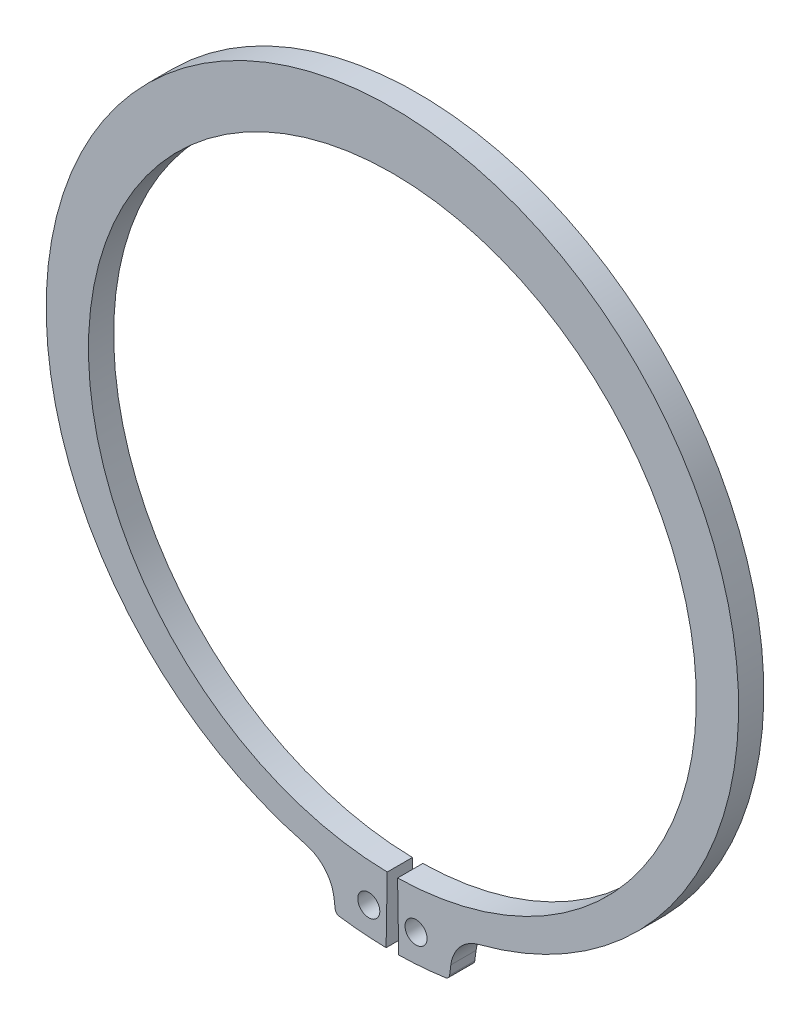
from build123d import *

# Parameters (mm, degrees)
BODYSKE_R  = 1.75
BODY_DEPTH = 4


with BuildPart() as part:
    # BodySke → Body (new body)
    with BuildSketch(Plane.XY):
        with BuildLine():
            Line((0.821276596, -48.243009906), (1, -58.741488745))
            ThreePointArc((1, -58.741488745), (4.729870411, -58.55929325), (8.440631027, -58.140504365))
            ThreePointArc((8.440631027, -58.140504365), (8.866715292, -57.925084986), (9.076461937, -57.496179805))
            Line((9.076461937, -57.496179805), (9.278802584, -55.959249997))
            ThreePointArc((9.278802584, -55.959249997), (10.734892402, -52.765463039), (13.728556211, -50.932855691))
            ThreePointArc((13.728556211, -50.932855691), (0, 57.25), (-13.728556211, -50.932855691))
            ThreePointArc((-13.728556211, -50.932855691), (-10.734892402, -52.765463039), (-9.278802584, -55.959249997))
            Line((-9.278802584, -55.959249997), (-9.076461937, -57.496179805))
            ThreePointArc((-9.076461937, -57.496179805), (-8.866715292, -57.925084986), (-8.440631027, -58.140504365))
            ThreePointArc((-8.440631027, -58.140504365), (-4.729870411, -58.55929325), (-1, -58.741488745))
            Line((-1, -58.741488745), (-0.821276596, -48.243009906))
            ThreePointArc((-0.821276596, -48.243009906), (0, 48.25), (0.821276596, -48.243009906))
        make_face()
        with Locations((3.75, -54.245535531)):
            Circle(BODYSKE_R, mode=Mode.SUBTRACT)
        with Locations((-3.75, -54.245535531)):
            Circle(BODYSKE_R, mode=Mode.SUBTRACT)
    extrude(amount=-BODY_DEPTH)


solid = part.part
